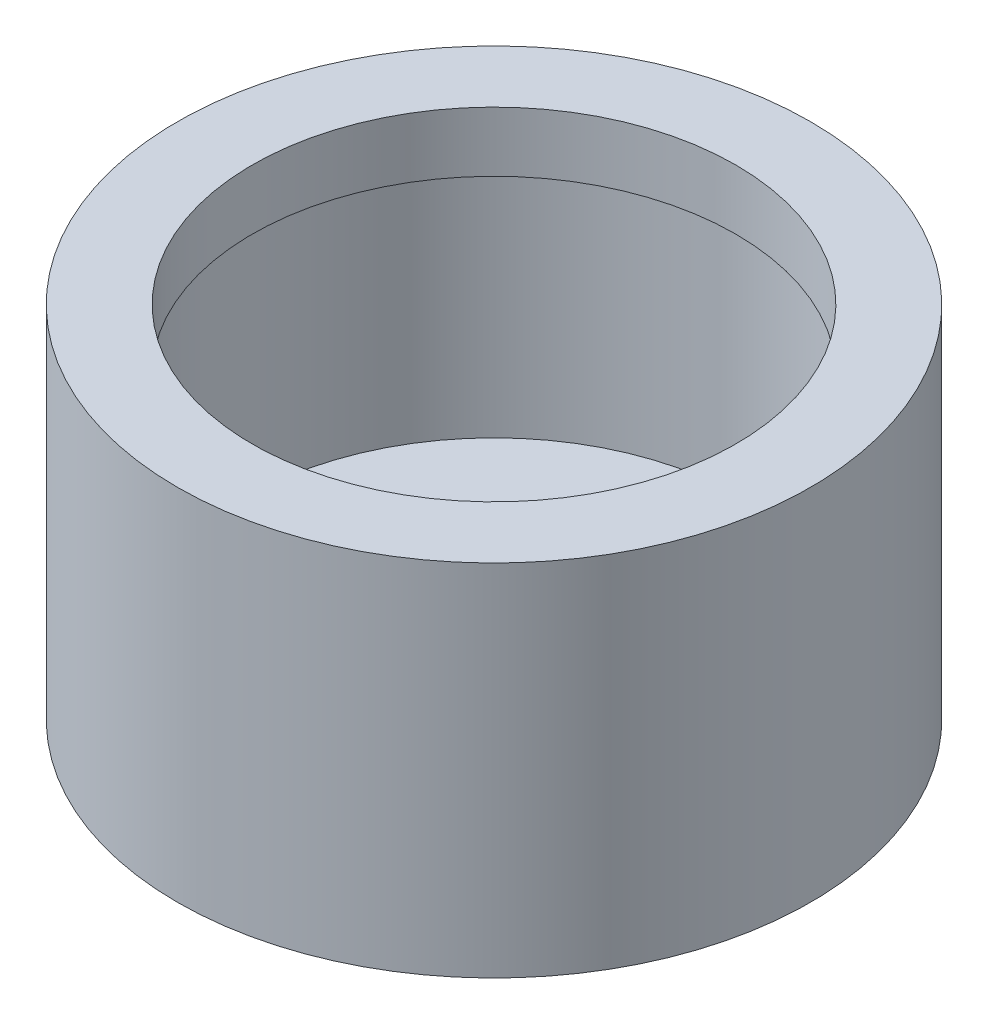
from build123d import *

# Parameters (mm, degrees)
F_4_40_TAPPED_HOLE1_D     = 2.2606
F_4_40_TAPPED_HOLE1_DEPTH = 6.35
F_4_40_TAPPED_HOLE1_TIP   = 0.679152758


with BuildPart() as part:
    # Sketch1 → Body (revolve)
    with BuildSketch(Plane.XY, mode=Mode.PRIVATE) as body_sk:
        Polygon((0, 0), (0, 4.064), (14.732, 4.064), (14.732, 17.78), (14.351, 17.78), (14.351, 21.336), (18.796, 21.336), (18.796, 0), align=None)
    revolve(body_sk.sketch.rotate(Axis((0, 4.064, 0), (0, 1, 0)), 90), axis=Axis((0, 4.064, 0), (0, 1, 0)))

    # 4-40 Tapped Hole1
    with Locations(Plane.XZ):
        with Locations((-7.62, 14.732), (7.62, 14.732)):
            Hole(F_4_40_TAPPED_HOLE1_D / 2, depth=F_4_40_TAPPED_HOLE1_DEPTH)
            with Locations((0, 0, -(F_4_40_TAPPED_HOLE1_DEPTH + F_4_40_TAPPED_HOLE1_TIP / 2))):  # 118° drill point
                Cone(0, F_4_40_TAPPED_HOLE1_D / 2, F_4_40_TAPPED_HOLE1_TIP, mode=Mode.SUBTRACT)


solid = part.part
